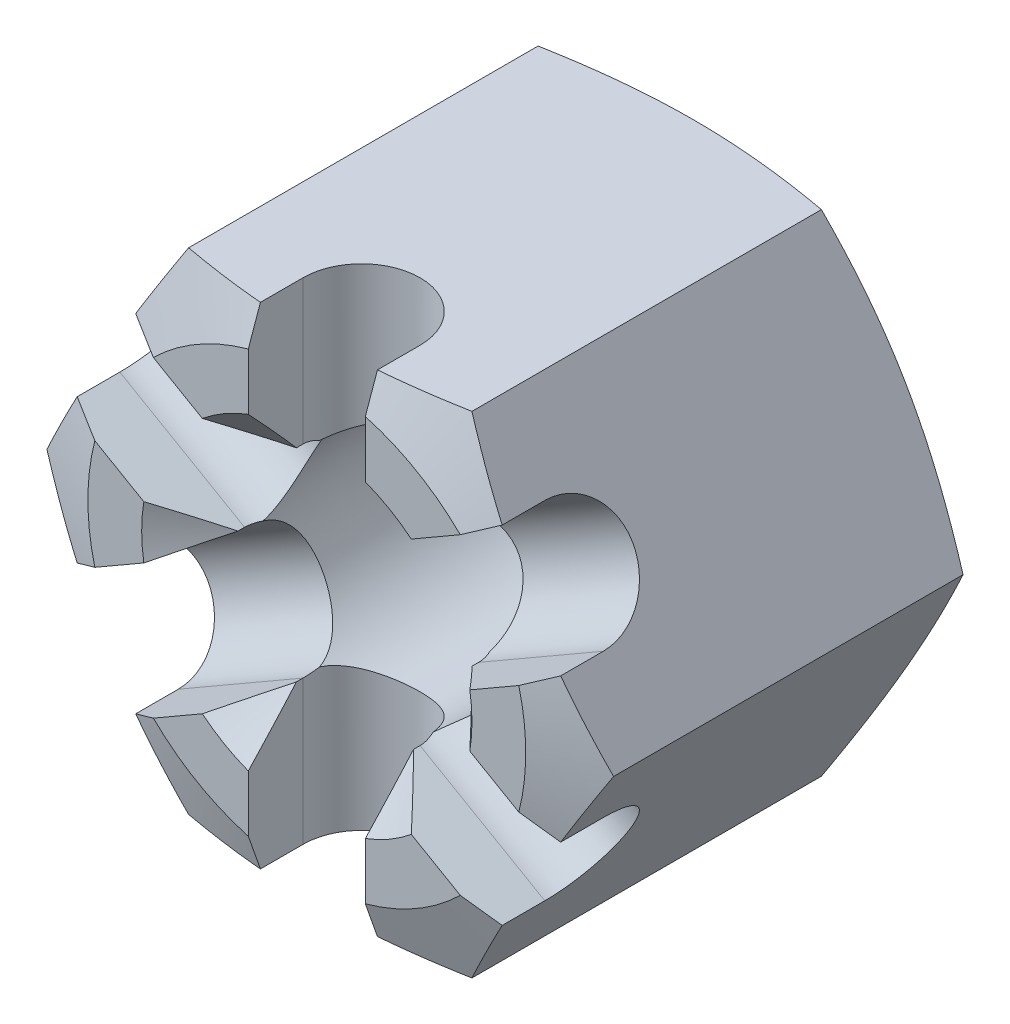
from build123d import *

# Parameters (mm, degrees)
BASENUT_DEPTH     = 10.5
SKETCH3_R         = 3
HOLE_DEPTH        = 18.803745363
SLOT_DEPTH        = 32.614253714
SLOTPATTERN_COUNT = 6


with BuildPart() as part:
    # Sketch1 → BaseNut (new body)
    with BuildSketch(Plane.XY):
        Polygon((3.75277675, -6.5), (7.505553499, 0), (3.75277675, 6.5), (-3.75277675, 6.5), (-7.505553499, 0), (-3.75277675, -6.5), align=None)
    extrude(amount=-BASENUT_DEPTH)

    # Sketch2 → Double-Chamfer (revolve, cut)
    with BuildSketch(Plane(origin=(-3.47179677, 0, -17.32820323), x_dir=(0, 0, -1), z_dir=(0, 1, 0))):
        Polygon((-6.82820323, 2.32820323), (-7.448973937, 4.03375673), (-6.82820323, 4.03375673), align=None)
        Polygon((-17.32820323, 2.32820323), (-17.32820323, 4.03375673), (-16.707432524, 4.03375673), align=None)
    revolve(axis=Axis((0, 0, -17.32820323), (0, 0, 1)), mode=Mode.SUBTRACT)

    # Sketch3 → Hole (cut, through all)
    with BuildSketch(Plane(origin=(-4.279914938, -1.735659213, -10.5), x_dir=(-1, 0, 0), z_dir=(0, 0, -1))):
        with Locations((-4.279914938, 1.735659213)):
            Circle(SKETCH3_R)
    extrude(amount=-HOLE_DEPTH, mode=Mode.SUBTRACT)

    # Sketch4 → EndChamfer (revolve, cut)
    with BuildSketch(Plane(origin=(-15.758283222, 0, -7.108283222), x_dir=(0, 0, -1), z_dir=(0, 1, 0)), mode=Mode.PRIVATE) as endchamfer_sk:
        Polygon((3.391716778, -20.133283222), (2.016716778, -18.758283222), (3.391716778, -18.758283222), align=None)
        Polygon((-7.108283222, -18.758283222), (-5.733283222, -18.758283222), (-7.108283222, -20.133283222), align=None)
    revolve(endchamfer_sk.sketch.rotate(Axis((0, 0, -7.108283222), (0, 0, 1)), 180), axis=Axis((0, 0, -7.108283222), (0, 0, 1)), mode=Mode.SUBTRACT)

    # Sketch5 → Slot (cut, through all)
    with BuildSketch(Plane(origin=(-17.8, 0, -17.8), x_dir=(0, 0, -1), z_dir=(0, 1, 0))):
        with BuildLine():
            Line((-17.8, -16.25), (-16.35, -16.25))
            ThreePointArc((-16.35, -16.25), (-14.8, -17.8), (-16.35, -19.35))
            Line((-16.35, -19.35), (-17.8, -19.35))
            Line((-17.8, -19.35), (-17.8, -16.25))
        make_face()
    slot = extrude(amount=-SLOT_DEPTH, mode=Mode.SUBTRACT)

    # SlotPattern: Slot ×6 about axis
    slotpattern_axis = Axis((0, 0, 0), (0, 0, 1))
    for i in range(1, SLOTPATTERN_COUNT):
        add(slot.rotate(slotpattern_axis, i * 360 / SLOTPATTERN_COUNT), mode=Mode.SUBTRACT)


solid = part.part
